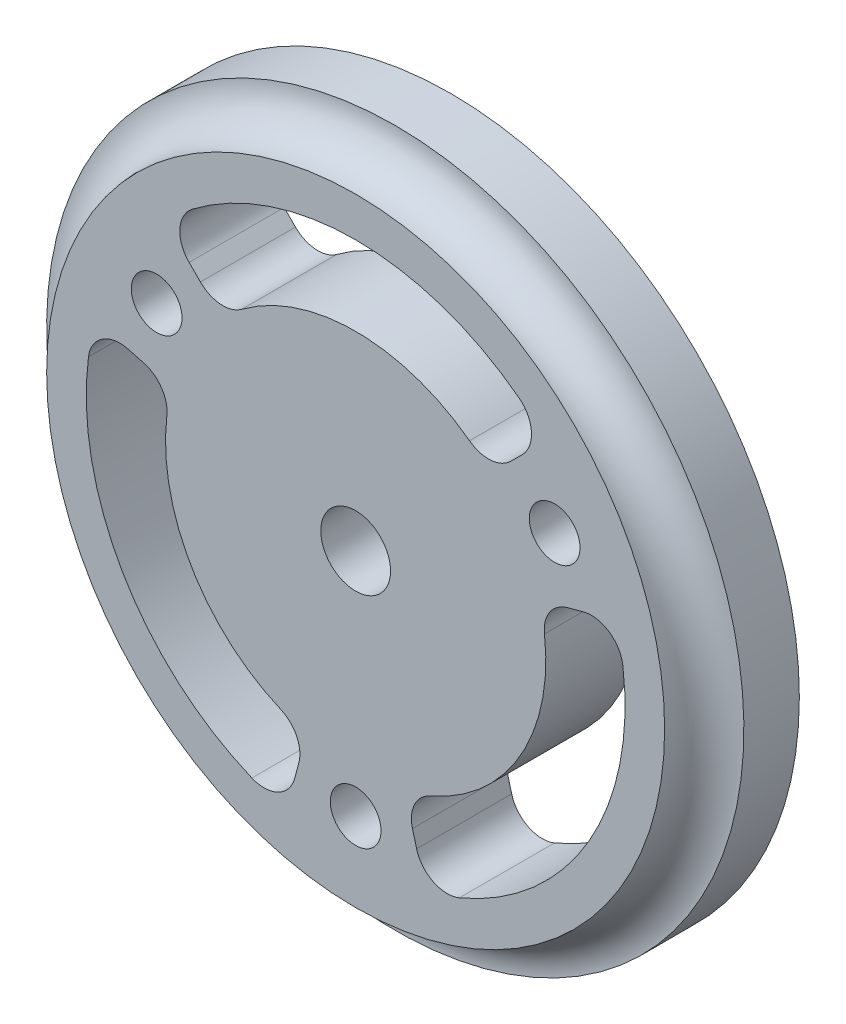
from build123d import *

# Parameters (mm, degrees)
ESQUISSE1_R      = 22
ESQUISSE1_R_2    = 2.2
ESQUISSE1_R_3    = 1.6
EXTRUSION1_DEPTH = 6


with BuildPart() as part:
    # Esquisse1 → Extrusion1 (new body)
    with BuildSketch(Plane.XY):
        Circle(ESQUISSE1_R)
        Circle(ESQUISSE1_R_2, mode=Mode.SUBTRACT)
        with Locations((0, -14.5)):
            Circle(ESQUISSE1_R_3, mode=Mode.SUBTRACT)
        with Locations((-12.557368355, 7.25)):
            Circle(ESQUISSE1_R_3, mode=Mode.SUBTRACT)
        with Locations((12.557368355, 7.25)):
            Circle(ESQUISSE1_R_3, mode=Mode.SUBTRACT)
        with BuildLine():
            Line((9.797958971, 9.797958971), (10.511898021, 10.511898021))
            ThreePointArc((10.511898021, 10.511898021), (11.09321509, 12.059743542), (10.310709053, 13.516259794))
            ThreePointArc((10.310709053, 13.516259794), (0, 17), (-10.310709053, 13.516259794))
            ThreePointArc((-10.310709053, 13.516259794), (-11.09321509, 12.059743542), (-10.511898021, 10.511898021))
            Line((-10.511898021, 10.511898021), (-9.797958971, 9.797958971))
            ThreePointArc((-9.797958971, 9.797958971), (-8.526970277, 9.217307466), (-7.186067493, 9.6104336))
            ThreePointArc((-7.186067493, 9.6104336), (0, 12), (7.186067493, 9.6104336))
            ThreePointArc((7.186067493, 9.6104336), (8.526970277, 9.217307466), (9.797958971, 9.797958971))
        make_face(mode=Mode.SUBTRACT)
        with BuildLine():
            Line((13.38426086, 3.586301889), (14.359519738, 3.847621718))
            ThreePointArc((14.359519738, 3.847621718), (15.990651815, 3.577134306), (16.860778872, 2.171206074))
            ThreePointArc((16.860778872, 2.171206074), (14.722431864, -8.5), (6.55006982, -15.687465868))
            ThreePointArc((6.55006982, -15.687465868), (4.897436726, -15.636877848), (3.847621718, -14.359519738))
            Line((3.847621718, -14.359519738), (3.586301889, -13.38426086))
            ThreePointArc((3.586301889, -13.38426086), (3.718937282, -11.99322661), (4.729845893, -11.028533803))
            ThreePointArc((4.729845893, -11.028533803), (10.392304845, -6), (11.915913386, 1.418100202))
            ThreePointArc((11.915913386, 1.418100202), (12.245907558, 2.775919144), (13.38426086, 3.586301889))
        make_face(mode=Mode.SUBTRACT)
        with BuildLine():
            Line((-3.586301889, -13.38426086), (-3.847621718, -14.359519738))
            ThreePointArc((-3.847621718, -14.359519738), (-4.897436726, -15.636877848), (-6.55006982, -15.687465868))
            ThreePointArc((-6.55006982, -15.687465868), (-14.722431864, -8.5), (-16.860778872, 2.171206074))
            ThreePointArc((-16.860778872, 2.171206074), (-15.990651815, 3.577134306), (-14.359519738, 3.847621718))
            Line((-14.359519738, 3.847621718), (-13.38426086, 3.586301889))
            ThreePointArc((-13.38426086, 3.586301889), (-12.245907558, 2.775919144), (-11.915913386, 1.418100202))
            ThreePointArc((-11.915913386, 1.418100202), (-10.392304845, -6), (-4.729845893, -11.028533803))
            ThreePointArc((-4.729845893, -11.028533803), (-3.718937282, -11.99322661), (-3.586301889, -13.38426086))
        make_face(mode=Mode.SUBTRACT)
    extrude(amount=EXTRUSION1_DEPTH)

    # Esquisse2 → Enl_vement de mati_re-R_volution1 (revolve, cut)
    with BuildSketch(Plane(origin=(0, 0, 0), x_dir=(0, 0, -1), z_dir=(1, 0, 0))):
        with BuildLine():
            Line((-3.5, 22), (-6, 22))
            Line((-6, 22), (-6, 19.5))
            ThreePointArc((-6, 19.5), (-4.232233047, 20.232233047), (-3.5, 22))
        make_face()
    revolve(axis=Axis((0, 0, -18.92274783), (0, 0, 1)), mode=Mode.SUBTRACT)


solid = part.part
